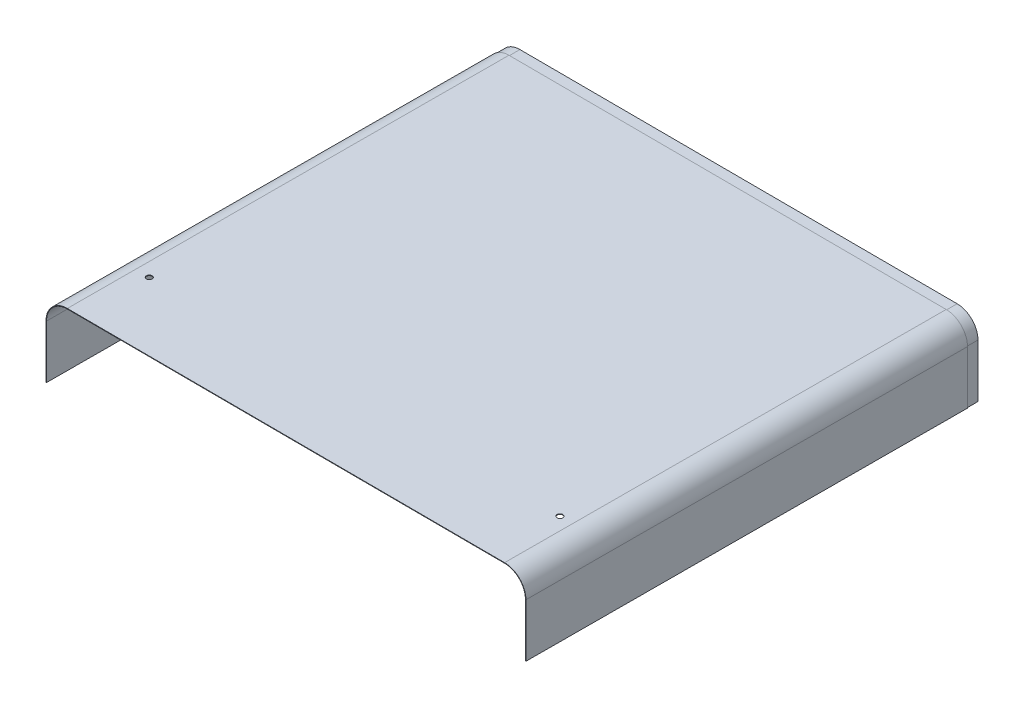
from build123d import *

# Parameters (mm, degrees)
EXTRUSION1_DEPTH        = 30
EXTRU_MINCE1_DEPTH      = 833.441956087
EXTRU_MINCE1_DEPTH_BACK = 9
ESQUISSE6_R             = 5.5
ENL_V_MAT_EXTRU_1_DEPTH = 10


with BuildPart() as part:
    # Esquisse1 → Extrusion1 (new body)
    with BuildSketch(Plane(origin=(-927.057672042, 0, -1.633596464), x_dir=(-0.9999937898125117, 0, -0.0035242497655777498), z_dir=(0.0035242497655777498, 0, -0.9999937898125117))):
        with BuildLine():
            Line((-414.54965876, 0), (-1254.54965876, 0))
            ThreePointArc((-1254.54965876, 0), (-1282.833930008, -11.715728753), (-1294.54965876, -40))
            Line((-1294.54965876, -40), (-1294.54965876, -142))
            Line((-1294.54965876, -142), (-1293.54965876, -142))
            Line((-1293.54965876, -142), (-1293.54965876, -40))
            ThreePointArc((-1293.54965876, -40), (-1282.126823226, -12.422835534), (-1254.54965876, -1))
            Line((-1254.54965876, -1), (-414.54965876, -1))
            ThreePointArc((-414.54965876, -1), (-386.972494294, -12.422835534), (-375.54965876, -40))
            Line((-375.54965876, -40), (-375.54965876, -142))
            Line((-375.54965876, -142), (-374.54965876, -142))
            Line((-374.54965876, -142), (-374.54965876, -40))
            ThreePointArc((-374.54965876, -40), (-386.265387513, -11.715728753), (-414.54965876, 0))
        make_face()
    extrude(amount=-EXTRUSION1_DEPTH)

    # Esquisse4 → Extru.-Mince1 (add, two sides: drawn at the far end of the back side and taken through both)
    with BuildSketch(Plane(origin=(-0.111484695, 0, 31.633400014), x_dir=(0.9999937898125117, 0, 0.0035242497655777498), z_dir=(-0.0035242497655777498, 0, 0.9999937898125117)).offset(-EXTRU_MINCE1_DEPTH_BACK)):
        with BuildLine():
            Line((-553.508013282, -142), (-553.508013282, -40))
            ThreePointArc((-553.508013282, -40), (-541.499391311, -11.008621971), (-512.508013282, 1))
            Line((-512.508013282, 1), (327.491986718, 1))
            ThreePointArc((327.491986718, 1), (356.483364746, -11.008621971), (368.491986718, -40))
            Line((368.491986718, -40), (368.491986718, -142))
            Line((368.491986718, -142), (367.491986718, -142))
            Line((367.491986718, -142), (367.491986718, -40))
            ThreePointArc((367.491986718, -40), (355.776257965, -11.715728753), (327.491986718, 0))
            Line((327.491986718, 0), (-512.508013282, 0))
            ThreePointArc((-512.508013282, 0), (-540.79228453, -11.715728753), (-552.508013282, -40))
            Line((-552.508013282, -40), (-552.508013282, -142))
            Line((-552.508013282, -142), (-553.508013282, -142))
        make_face()
    extrude(amount=EXTRU_MINCE1_DEPTH + EXTRU_MINCE1_DEPTH_BACK)

    # Esquisse6 → Enl_v. mat.-Extru.1 (cut)
    with BuildSketch(Plane(origin=(0, 1, 0), x_dir=(-1, 0, 0), z_dir=(0, 1, 0))):
        with Locations((-300.399515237, 736.138807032)):
            Circle(ESQUISSE6_R)
        with Locations((488.595584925, 733.358173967)):
            Circle(ESQUISSE6_R)
    extrude(amount=-ENL_V_MAT_EXTRU_1_DEPTH, mode=Mode.SUBTRACT)


solid = part.part
